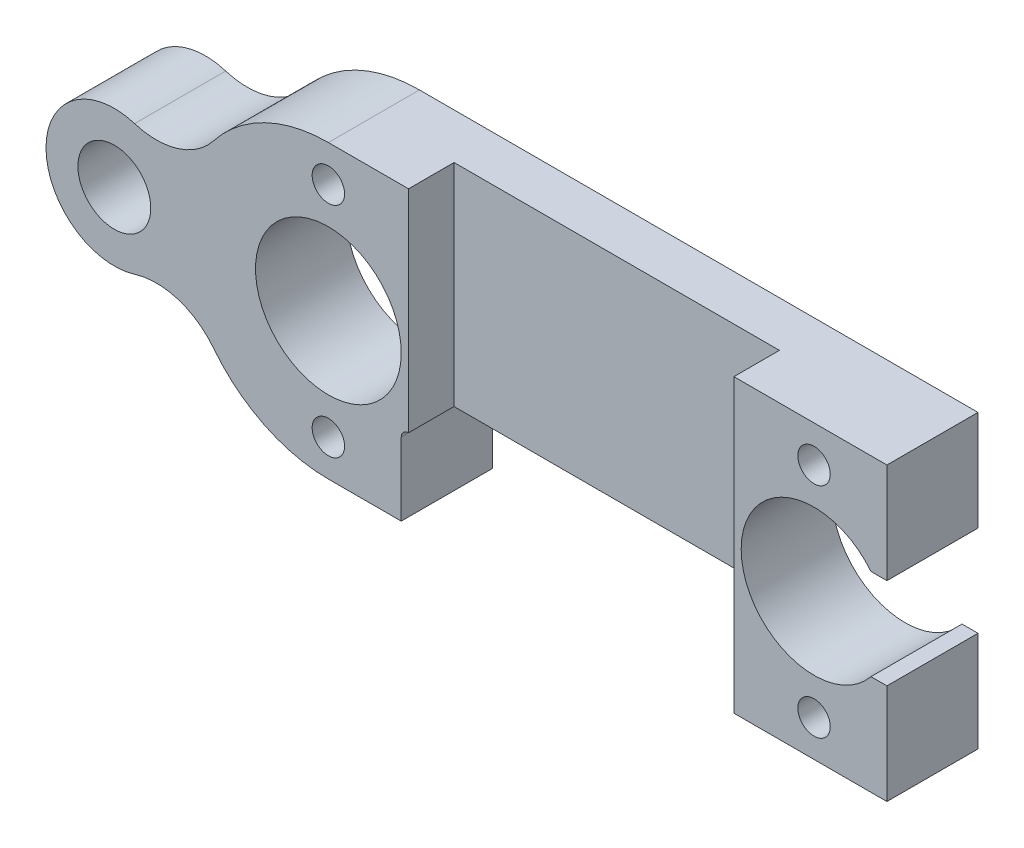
ISO-10303-21;
HEADER;
FILE_DESCRIPTION(('STEP AP214'),'2;1');
FILE_NAME('part.step','',(''),(''),'','','');
FILE_SCHEMA(('AUTOMOTIVE_DESIGN { 1 0 10303 214 1 1 1 1 }'));
ENDSEC;
DATA;
#1=APPLICATION_CONTEXT('core data for automotive mechanical design processes');
#2=APPLICATION_PROTOCOL_DEFINITION('international standard','automotive_design',2000,#1);
#3=PRODUCT_CONTEXT('',#1,'mechanical');
#4=PRODUCT('Part','Part','',(#3));
#5=PRODUCT_RELATED_PRODUCT_CATEGORY('part','',(#4));
#6=PRODUCT_DEFINITION_FORMATION('','',#4);
#7=PRODUCT_DEFINITION_CONTEXT('part definition',#1,'design');
#8=PRODUCT_DEFINITION('design','',#6,#7);
#9=PRODUCT_DEFINITION_SHAPE('','',#8);
#10=(LENGTH_UNIT() NAMED_UNIT(*) SI_UNIT(.MILLI.,.METRE.));
#11=(NAMED_UNIT(*) PLANE_ANGLE_UNIT() SI_UNIT($,.RADIAN.));
#12=(NAMED_UNIT(*) SI_UNIT($,.STERADIAN.) SOLID_ANGLE_UNIT());
#13=UNCERTAINTY_MEASURE_WITH_UNIT(LENGTH_MEASURE(1.E-05),#10,'distance_accuracy_value','');
#14=(GEOMETRIC_REPRESENTATION_CONTEXT(3) GLOBAL_UNCERTAINTY_ASSIGNED_CONTEXT((#13)) GLOBAL_UNIT_ASSIGNED_CONTEXT((#10,
#11,#12)) REPRESENTATION_CONTEXT('',''));
#15=CARTESIAN_POINT('',(0.,0.,0.));
#16=DIRECTION('',(0.,0.,1.));
#17=DIRECTION('',(1.,0.,0.));
#18=AXIS2_PLACEMENT_3D('',#15,#16,#17);
#19=CARTESIAN_POINT('',(-14.6052067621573,5.3846618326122,6.35));
#20=DIRECTION('',(0.,0.,1.));
#21=DIRECTION('',(1.,0.,0.));
#22=AXIS2_PLACEMENT_3D('',#19,#20,#21);
#23=PLANE('',#22);
#24=DIRECTION('',(-1.,0.,0.));
#25=VECTOR('',#24,1.);
#26=CARTESIAN_POINT('',(24.3329932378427,15.5446618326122,6.35));
#27=LINE('',#26,#25);
#28=CARTESIAN_POINT('',(24.3329932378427,15.5446618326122,6.35));
#29=VERTEX_POINT('',#28);
#30=CARTESIAN_POINT('',(13.6649932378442,15.5446618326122,6.35));
#31=VERTEX_POINT('',#30);
#32=EDGE_CURVE('E241',#29,#31,#27,.T.);
#33=ORIENTED_EDGE('',*,*,#32,.T.);
#34=DIRECTION('',(0.,-1.,0.));
#35=VECTOR('',#34,1.);
#36=CARTESIAN_POINT('',(13.6649932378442,-4.77533816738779,6.35));
#37=LINE('',#36,#35);
#38=CARTESIAN_POINT('',(13.6649932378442,-4.77533816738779,6.35));
#39=VERTEX_POINT('',#38);
#40=EDGE_CURVE('E185',#31,#39,#37,.T.);
#41=ORIENTED_EDGE('',*,*,#40,.T.);
#42=DIRECTION('',(1.,0.,0.));
#43=VECTOR('',#42,1.);
#44=CARTESIAN_POINT('',(13.6649932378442,-4.77533816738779,6.35));
#45=LINE('',#44,#43);
#46=CARTESIAN_POINT('',(24.3329932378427,-4.77533816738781,6.35));
#47=VERTEX_POINT('',#46);
#48=EDGE_CURVE('E259',#39,#47,#45,.T.);
#49=ORIENTED_EDGE('',*,*,#48,.T.);
#50=DIRECTION('',(0.,1.,0.));
#51=VECTOR('',#50,1.);
#52=CARTESIAN_POINT('',(24.3329932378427,-4.77533816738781,6.35));
#53=LINE('',#52,#51);
#54=CARTESIAN_POINT('',(24.3329932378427,2.2096618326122,6.35));
#55=VERTEX_POINT('',#54);
#56=EDGE_CURVE('E261',#47,#55,#53,.T.);
#57=ORIENTED_EDGE('',*,*,#56,.T.);
#58=DIRECTION('',(-1.,0.,0.));
#59=VECTOR('',#58,1.);
#60=CARTESIAN_POINT('',(23.2185669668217,2.2096618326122,6.35));
#61=LINE('',#60,#59);
#62=CARTESIAN_POINT('',(23.2185669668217,2.2096618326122,6.35));
#63=VERTEX_POINT('',#62);
#64=EDGE_CURVE('E263',#55,#63,#61,.T.);
#65=ORIENTED_EDGE('',*,*,#64,.T.);
#66=CARTESIAN_POINT('',(19.2529932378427,5.38466183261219,6.35));
#67=DIRECTION('',(0.,0.,-1.));
#68=DIRECTION('',(1.,0.,0.));
#69=AXIS2_PLACEMENT_3D('',#66,#67,#68);
#70=CIRCLE('',#69,5.07999999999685);
#71=CARTESIAN_POINT('',(23.2185669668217,8.55966183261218,6.35));
#72=VERTEX_POINT('',#71);
#73=EDGE_CURVE('E265',#63,#72,#70,.T.);
#74=ORIENTED_EDGE('',*,*,#73,.T.);
#75=DIRECTION('',(1.,0.,0.));
#76=VECTOR('',#75,1.);
#77=CARTESIAN_POINT('',(24.3329932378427,8.55966183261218,6.35));
#78=LINE('',#77,#76);
#79=CARTESIAN_POINT('',(24.3329932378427,8.55966183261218,6.35));
#80=VERTEX_POINT('',#79);
#81=EDGE_CURVE('E267',#72,#80,#78,.T.);
#82=ORIENTED_EDGE('',*,*,#81,.T.);
#83=DIRECTION('',(0.,1.,0.));
#84=VECTOR('',#83,1.);
#85=CARTESIAN_POINT('',(24.3329932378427,8.55966183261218,6.35));
#86=LINE('',#85,#84);
#87=EDGE_CURVE('E236',#80,#29,#86,.T.);
#88=ORIENTED_EDGE('',*,*,#87,.T.);
#89=EDGE_LOOP('',(#33,#41,#49,#57,#65,#74,#82,#88));
#90=FACE_BOUND('',#89,.T.);
#91=CARTESIAN_POINT('',(19.2529932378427,13.0046618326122,6.35));
#92=DIRECTION('',(0.,0.,1.));
#93=DIRECTION('',(1.,0.,0.));
#94=AXIS2_PLACEMENT_3D('',#91,#92,#93);
#95=CIRCLE('',#94,1.13029999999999);
#96=CARTESIAN_POINT('',(20.3832932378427,13.0046618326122,6.35));
#97=VERTEX_POINT('',#96);
#98=EDGE_CURVE('E205',#97,#97,#95,.T.);
#99=ORIENTED_EDGE('',*,*,#98,.F.);
#100=EDGE_LOOP('',(#99));
#101=FACE_BOUND('',#100,.T.);
#102=CARTESIAN_POINT('',(19.2529932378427,-2.23533816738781,6.35));
#103=DIRECTION('',(0.,0.,1.));
#104=DIRECTION('',(1.,0.,0.));
#105=AXIS2_PLACEMENT_3D('',#102,#103,#104);
#106=CIRCLE('',#105,1.13029999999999);
#107=CARTESIAN_POINT('',(20.3832932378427,-2.23533816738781,6.35));
#108=VERTEX_POINT('',#107);
#109=EDGE_CURVE('E199',#108,#108,#106,.T.);
#110=ORIENTED_EDGE('',*,*,#109,.F.);
#111=EDGE_LOOP('',(#110));
#112=FACE_BOUND('',#111,.T.);
#113=ADVANCED_FACE('F33',(#90,#101,#112),#23,.T.);
#114=CARTESIAN_POINT('',(13.6649932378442,0.812661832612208,6.35));
#115=DIRECTION('',(0.,1.,0.));
#116=DIRECTION('',(-1.,0.,0.));
#117=AXIS2_PLACEMENT_3D('',#114,#115,#116);
#118=PLANE('',#117);
#119=DIRECTION('',(1.,0.,0.));
#120=VECTOR('',#119,1.);
#121=CARTESIAN_POINT('',(13.6649932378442,0.812661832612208,3.175));
#122=LINE('',#121,#120);
#123=CARTESIAN_POINT('',(-9.01720676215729,0.812661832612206,3.175));
#124=VERTEX_POINT('',#123);
#125=CARTESIAN_POINT('',(13.1569932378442,0.812661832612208,3.175));
#126=VERTEX_POINT('',#125);
#127=EDGE_CURVE('E47',#124,#126,#122,.T.);
#128=ORIENTED_EDGE('',*,*,#127,.F.);
#129=DIRECTION('',(0.,0.,-1.));
#130=VECTOR('',#129,1.);
#131=CARTESIAN_POINT('',(-9.01720676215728,0.812661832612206,0.));
#132=LINE('',#131,#130);
#133=CARTESIAN_POINT('',(-9.01720676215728,0.812661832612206,0.));
#134=VERTEX_POINT('',#133);
#135=EDGE_CURVE('E346',#124,#134,#132,.T.);
#136=ORIENTED_EDGE('',*,*,#135,.T.);
#137=DIRECTION('',(1.,0.,0.));
#138=VECTOR('',#137,1.);
#139=CARTESIAN_POINT('',(13.6649932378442,0.812661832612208,0.));
#140=LINE('',#139,#138);
#141=CARTESIAN_POINT('',(13.1569932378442,0.812661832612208,0.));
#142=VERTEX_POINT('',#141);
#143=EDGE_CURVE('E289',#134,#142,#140,.T.);
#144=ORIENTED_EDGE('',*,*,#143,.T.);
#145=DIRECTION('',(0.,0.,-1.));
#146=VECTOR('',#145,1.);
#147=CARTESIAN_POINT('',(13.1569932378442,0.812661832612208,6.35));
#148=LINE('',#147,#146);
#149=EDGE_CURVE('E343',#142,#126,#148,.F.);
#150=ORIENTED_EDGE('',*,*,#149,.T.);
#151=EDGE_LOOP('',(#128,#136,#144,#150));
#152=FACE_BOUND('',#151,.T.);
#153=ADVANCED_FACE('F366',(#152),#118,.F.);
#154=CARTESIAN_POINT('',(13.1569932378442,0.304661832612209,6.35));
#155=DIRECTION('',(0.,0.,1.));
#156=DIRECTION('',(1.,0.,0.));
#157=AXIS2_PLACEMENT_3D('',#154,#155,#156);
#158=CYLINDRICAL_SURFACE('',#157,0.508);
#159=CARTESIAN_POINT('',(13.1569932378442,0.304661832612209,3.175));
#160=DIRECTION('',(0.,0.,1.));
#161=DIRECTION('',(1.,0.,0.));
#162=AXIS2_PLACEMENT_3D('',#159,#160,#161);
#163=CIRCLE('',#162,0.508);
#164=CARTESIAN_POINT('',(13.6649932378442,0.304661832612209,3.175));
#165=VERTEX_POINT('',#164);
#166=EDGE_CURVE('E11',#126,#165,#163,.F.);
#167=ORIENTED_EDGE('',*,*,#166,.F.);
#168=ORIENTED_EDGE('',*,*,#149,.F.);
#169=CARTESIAN_POINT('',(13.1569932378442,0.304661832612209,0.));
#170=DIRECTION('',(0.,0.,1.));
#171=DIRECTION('',(1.,0.,0.));
#172=AXIS2_PLACEMENT_3D('',#169,#170,#171);
#173=CIRCLE('',#172,0.508);
#174=CARTESIAN_POINT('',(13.6649932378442,0.304661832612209,0.));
#175=VERTEX_POINT('',#174);
#176=EDGE_CURVE('E41',#175,#142,#173,.T.);
#177=ORIENTED_EDGE('',*,*,#176,.F.);
#178=DIRECTION('',(0.,0.,-1.));
#179=VECTOR('',#178,1.);
#180=CARTESIAN_POINT('',(13.6649932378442,0.304661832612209,0.));
#181=LINE('',#180,#179);
#182=EDGE_CURVE('E55',#165,#175,#181,.T.);
#183=ORIENTED_EDGE('',*,*,#182,.F.);
#184=EDGE_LOOP('',(#167,#168,#177,#183));
#185=FACE_BOUND('',#184,.T.);
#186=ADVANCED_FACE('F35',(#185),#158,.F.);
#187=DIRECTION('',(0.,-1.,0.));
#188=VECTOR('',#187,1.);
#189=CARTESIAN_POINT('',(-9.01720676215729,-4.77533816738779,6.35));
#190=LINE('',#189,#188);
#191=CARTESIAN_POINT('',(-9.0172067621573,15.5446618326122,6.35));
#192=VERTEX_POINT('',#191);
#193=CARTESIAN_POINT('',(-9.01720676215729,0.812661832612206,6.35));
#194=VERTEX_POINT('',#193);
#195=EDGE_CURVE('E179',#192,#194,#190,.T.);
#196=ORIENTED_EDGE('',*,*,#195,.F.);
#197=CARTESIAN_POINT('',(-14.6052067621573,15.5446618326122,6.35));
#198=VERTEX_POINT('',#197);
#199=EDGE_CURVE('E239',#192,#198,#27,.T.);
#200=ORIENTED_EDGE('',*,*,#199,.T.);
#201=CARTESIAN_POINT('',(-14.6052067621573,5.3846618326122,6.35));
#202=DIRECTION('',(0.,0.,1.));
#203=DIRECTION('',(1.,0.,0.));
#204=AXIS2_PLACEMENT_3D('',#201,#202,#203);
#205=CIRCLE('',#204,10.16);
#206=CARTESIAN_POINT('',(-22.603504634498,11.6498698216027,6.35));
#207=VERTEX_POINT('',#206);
#208=EDGE_CURVE('E243',#198,#207,#205,.T.);
#209=ORIENTED_EDGE('',*,*,#208,.T.);
#210=CARTESIAN_POINT('',(-26.6026535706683,14.7824738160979,6.35));
#211=DIRECTION('',(0.,0.,-1.));
#212=DIRECTION('',(1.,0.,0.));
#213=AXIS2_PLACEMENT_3D('',#210,#211,#212);
#214=CIRCLE('',#213,5.08);
#215=CARTESIAN_POINT('',(-28.112358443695,9.93199021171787,6.35));
#216=VERTEX_POINT('',#215);
#217=EDGE_CURVE('E245',#207,#216,#214,.T.);
#218=ORIENTED_EDGE('',*,*,#217,.T.);
#219=CARTESIAN_POINT('',(-29.5277067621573,5.38466183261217,6.35));
#220=DIRECTION('',(0.,0.,1.));
#221=DIRECTION('',(1.,0.,0.));
#222=AXIS2_PLACEMENT_3D('',#219,#220,#221);
#223=CIRCLE('',#222,4.76249999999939);
#224=CARTESIAN_POINT('',(-28.112358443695,0.837333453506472,6.35));
#225=VERTEX_POINT('',#224);
#226=EDGE_CURVE('E247',#216,#225,#223,.T.);
#227=ORIENTED_EDGE('',*,*,#226,.T.);
#228=CARTESIAN_POINT('',(-26.6026535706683,-4.01315015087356,6.35));
#229=DIRECTION('',(0.,0.,-1.));
#230=DIRECTION('',(-1.,0.,0.));
#231=AXIS2_PLACEMENT_3D('',#228,#229,#230);
#232=CIRCLE('',#231,5.08);
#233=CARTESIAN_POINT('',(-22.603504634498,-0.880546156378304,6.35));
#234=VERTEX_POINT('',#233);
#235=EDGE_CURVE('E249',#225,#234,#232,.T.);
#236=ORIENTED_EDGE('',*,*,#235,.T.);
#237=CARTESIAN_POINT('',(-14.6052067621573,5.3846618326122,6.35));
#238=DIRECTION('',(0.,0.,1.));
#239=DIRECTION('',(1.,0.,0.));
#240=AXIS2_PLACEMENT_3D('',#237,#238,#239);
#241=CIRCLE('',#240,10.16);
#242=CARTESIAN_POINT('',(-14.6052067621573,-4.77533816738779,6.35));
#243=VERTEX_POINT('',#242);
#244=EDGE_CURVE('E251',#234,#243,#241,.T.);
#245=ORIENTED_EDGE('',*,*,#244,.T.);
#246=DIRECTION('',(1.,0.,0.));
#247=VECTOR('',#246,1.);
#248=CARTESIAN_POINT('',(-14.6052067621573,-4.77533816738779,6.35));
#249=LINE('',#248,#247);
#250=CARTESIAN_POINT('',(-9.52520676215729,-4.77533816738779,6.35));
#251=VERTEX_POINT('',#250);
#252=EDGE_CURVE('E253',#243,#251,#249,.T.);
#253=ORIENTED_EDGE('',*,*,#252,.T.);
#254=DIRECTION('',(0.,1.,0.));
#255=VECTOR('',#254,1.);
#256=CARTESIAN_POINT('',(-9.52520676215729,0.812661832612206,6.35));
#257=LINE('',#256,#255);
#258=CARTESIAN_POINT('',(-9.52520676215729,0.304661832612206,6.35));
#259=VERTEX_POINT('',#258);
#260=EDGE_CURVE('E255',#251,#259,#257,.T.);
#261=ORIENTED_EDGE('',*,*,#260,.T.);
#262=CARTESIAN_POINT('',(-9.01720676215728,0.304661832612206,6.35));
#263=DIRECTION('',(0.,0.,1.));
#264=DIRECTION('',(1.,0.,0.));
#265=AXIS2_PLACEMENT_3D('',#262,#263,#264);
#266=CIRCLE('',#265,0.508);
#267=EDGE_CURVE('E354',#259,#194,#266,.F.);
#268=ORIENTED_EDGE('',*,*,#267,.T.);
#269=EDGE_LOOP('',(#196,#200,#209,#218,#227,#236,#245,#253,#261,#268));
#270=FACE_BOUND('',#269,.T.);
#271=CARTESIAN_POINT('',(-14.6052067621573,13.0046618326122,6.35));
#272=DIRECTION('',(0.,0.,1.));
#273=DIRECTION('',(1.,0.,0.));
#274=AXIS2_PLACEMENT_3D('',#271,#272,#273);
#275=CIRCLE('',#274,1.13029999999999);
#276=CARTESIAN_POINT('',(-13.4749067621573,13.0046618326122,6.35));
#277=VERTEX_POINT('',#276);
#278=EDGE_CURVE('E211',#277,#277,#275,.T.);
#279=ORIENTED_EDGE('',*,*,#278,.F.);
#280=EDGE_LOOP('',(#279));
#281=FACE_BOUND('',#280,.T.);
#282=CARTESIAN_POINT('',(-14.6052067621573,-2.23533816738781,6.35));
#283=DIRECTION('',(0.,0.,1.));
#284=DIRECTION('',(1.,0.,0.));
#285=AXIS2_PLACEMENT_3D('',#282,#283,#284);
#286=CIRCLE('',#285,1.13029999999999);
#287=CARTESIAN_POINT('',(-13.4749067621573,-2.23533816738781,6.35));
#288=VERTEX_POINT('',#287);
#289=EDGE_CURVE('E217',#288,#288,#286,.T.);
#290=ORIENTED_EDGE('',*,*,#289,.F.);
#291=EDGE_LOOP('',(#290));
#292=FACE_BOUND('',#291,.T.);
#293=CARTESIAN_POINT('',(-14.6052067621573,5.3846618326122,6.35));
#294=DIRECTION('',(0.,0.,1.));
#295=DIRECTION('',(1.,0.,0.));
#296=AXIS2_PLACEMENT_3D('',#293,#294,#295);
#297=CIRCLE('',#296,5.07999999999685);
#298=CARTESIAN_POINT('',(-9.52520676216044,5.3846618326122,6.35));
#299=VERTEX_POINT('',#298);
#300=EDGE_CURVE('E230',#299,#299,#297,.T.);
#301=ORIENTED_EDGE('',*,*,#300,.F.);
#302=EDGE_LOOP('',(#301));
#303=FACE_BOUND('',#302,.T.);
#304=CARTESIAN_POINT('',(-29.5277067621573,5.38466183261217,6.35));
#305=DIRECTION('',(0.,0.,1.));
#306=DIRECTION('',(1.,0.,0.));
#307=AXIS2_PLACEMENT_3D('',#304,#305,#306);
#308=CIRCLE('',#307,2.53999999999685);
#309=CARTESIAN_POINT('',(-26.9877067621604,5.38466183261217,6.35));
#310=VERTEX_POINT('',#309);
#311=EDGE_CURVE('E224',#310,#310,#308,.T.);
#312=ORIENTED_EDGE('',*,*,#311,.F.);
#313=EDGE_LOOP('',(#312));
#314=FACE_BOUND('',#313,.T.);
#315=ADVANCED_FACE('F370',(#270,#281,#292,#303,#314),#23,.T.);
#316=CARTESIAN_POINT('',(-14.6052067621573,5.3846618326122,0.));
#317=DIRECTION('',(0.,0.,1.));
#318=DIRECTION('',(1.,0.,0.));
#319=AXIS2_PLACEMENT_3D('',#316,#317,#318);
#320=PLANE('',#319);
#321=CARTESIAN_POINT('',(19.2529932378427,-2.23533816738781,0.));
#322=DIRECTION('',(0.,0.,1.));
#323=DIRECTION('',(1.,0.,0.));
#324=AXIS2_PLACEMENT_3D('',#321,#322,#323);
#325=CIRCLE('',#324,1.1303);
#326=CARTESIAN_POINT('',(20.3832932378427,-2.23533816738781,0.));
#327=VERTEX_POINT('',#326);
#328=EDGE_CURVE('E202',#327,#327,#325,.T.);
#329=ORIENTED_EDGE('',*,*,#328,.T.);
#330=EDGE_LOOP('',(#329));
#331=FACE_BOUND('',#330,.T.);
#332=CARTESIAN_POINT('',(19.2529932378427,13.0046618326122,0.));
#333=DIRECTION('',(0.,0.,1.));
#334=DIRECTION('',(1.,0.,0.));
#335=AXIS2_PLACEMENT_3D('',#332,#333,#334);
#336=CIRCLE('',#335,1.1303);
#337=CARTESIAN_POINT('',(20.3832932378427,13.0046618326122,0.));
#338=VERTEX_POINT('',#337);
#339=EDGE_CURVE('E208',#338,#338,#336,.T.);
#340=ORIENTED_EDGE('',*,*,#339,.T.);
#341=EDGE_LOOP('',(#340));
#342=FACE_BOUND('',#341,.T.);
#343=CARTESIAN_POINT('',(-14.6052067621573,13.0046618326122,0.));
#344=DIRECTION('',(0.,0.,1.));
#345=DIRECTION('',(1.,0.,0.));
#346=AXIS2_PLACEMENT_3D('',#343,#344,#345);
#347=CIRCLE('',#346,1.1303);
#348=CARTESIAN_POINT('',(-13.4749067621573,13.0046618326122,0.));
#349=VERTEX_POINT('',#348);
#350=EDGE_CURVE('E214',#349,#349,#347,.T.);
#351=ORIENTED_EDGE('',*,*,#350,.T.);
#352=EDGE_LOOP('',(#351));
#353=FACE_BOUND('',#352,.T.);
#354=CARTESIAN_POINT('',(-14.6052067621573,-2.23533816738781,0.));
#355=DIRECTION('',(0.,0.,1.));
#356=DIRECTION('',(1.,0.,0.));
#357=AXIS2_PLACEMENT_3D('',#354,#355,#356);
#358=CIRCLE('',#357,1.1303);
#359=CARTESIAN_POINT('',(-13.4749067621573,-2.23533816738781,0.));
#360=VERTEX_POINT('',#359);
#361=EDGE_CURVE('E220',#360,#360,#358,.T.);
#362=ORIENTED_EDGE('',*,*,#361,.T.);
#363=EDGE_LOOP('',(#362));
#364=FACE_BOUND('',#363,.T.);
#365=CARTESIAN_POINT('',(-14.6052067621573,5.3846618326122,0.));
#366=DIRECTION('',(0.,0.,1.));
#367=DIRECTION('',(1.,0.,0.));
#368=AXIS2_PLACEMENT_3D('',#365,#366,#367);
#369=CIRCLE('',#368,5.07999999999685);
#370=CARTESIAN_POINT('',(-9.52520676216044,5.3846618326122,0.));
#371=VERTEX_POINT('',#370);
#372=EDGE_CURVE('E227',#371,#371,#369,.T.);
#373=ORIENTED_EDGE('',*,*,#372,.T.);
#374=EDGE_LOOP('',(#373));
#375=FACE_BOUND('',#374,.T.);
#376=DIRECTION('',(0.,1.,0.));
#377=VECTOR('',#376,1.);
#378=CARTESIAN_POINT('',(24.3329932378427,8.55966183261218,0.));
#379=LINE('',#378,#377);
#380=CARTESIAN_POINT('',(24.3329932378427,8.55966183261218,0.));
#381=VERTEX_POINT('',#380);
#382=CARTESIAN_POINT('',(24.3329932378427,15.5446618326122,0.));
#383=VERTEX_POINT('',#382);
#384=EDGE_CURVE('E233',#381,#383,#379,.T.);
#385=ORIENTED_EDGE('',*,*,#384,.F.);
#386=DIRECTION('',(1.,0.,0.));
#387=VECTOR('',#386,1.);
#388=CARTESIAN_POINT('',(24.3329932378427,8.55966183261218,0.));
#389=LINE('',#388,#387);
#390=CARTESIAN_POINT('',(23.2185669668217,8.55966183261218,0.));
#391=VERTEX_POINT('',#390);
#392=EDGE_CURVE('E240',#391,#381,#389,.T.);
#393=ORIENTED_EDGE('',*,*,#392,.F.);
#394=CARTESIAN_POINT('',(19.2529932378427,5.38466183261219,0.));
#395=DIRECTION('',(0.,0.,-1.));
#396=DIRECTION('',(1.,0.,0.));
#397=AXIS2_PLACEMENT_3D('',#394,#395,#396);
#398=CIRCLE('',#397,5.07999999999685);
#399=CARTESIAN_POINT('',(23.2185669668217,2.2096618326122,0.));
#400=VERTEX_POINT('',#399);
#401=EDGE_CURVE('E300',#400,#391,#398,.T.);
#402=ORIENTED_EDGE('',*,*,#401,.F.);
#403=DIRECTION('',(-1.,0.,0.));
#404=VECTOR('',#403,1.);
#405=CARTESIAN_POINT('',(23.2185669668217,2.2096618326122,0.));
#406=LINE('',#405,#404);
#407=CARTESIAN_POINT('',(24.3329932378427,2.2096618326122,0.));
#408=VERTEX_POINT('',#407);
#409=EDGE_CURVE('E298',#408,#400,#406,.T.);
#410=ORIENTED_EDGE('',*,*,#409,.F.);
#411=DIRECTION('',(0.,1.,0.));
#412=VECTOR('',#411,1.);
#413=CARTESIAN_POINT('',(24.3329932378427,-4.77533816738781,0.));
#414=LINE('',#413,#412);
#415=CARTESIAN_POINT('',(24.3329932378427,-4.77533816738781,0.));
#416=VERTEX_POINT('',#415);
#417=EDGE_CURVE('E296',#416,#408,#414,.T.);
#418=ORIENTED_EDGE('',*,*,#417,.F.);
#419=DIRECTION('',(1.,0.,0.));
#420=VECTOR('',#419,1.);
#421=CARTESIAN_POINT('',(13.6649932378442,-4.77533816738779,0.));
#422=LINE('',#421,#420);
#423=CARTESIAN_POINT('',(13.6649932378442,-4.77533816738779,0.));
#424=VERTEX_POINT('',#423);
#425=EDGE_CURVE('E294',#424,#416,#422,.T.);
#426=ORIENTED_EDGE('',*,*,#425,.F.);
#427=DIRECTION('',(0.,-1.,0.));
#428=VECTOR('',#427,1.);
#429=CARTESIAN_POINT('',(13.6649932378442,-4.77533816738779,0.));
#430=LINE('',#429,#428);
#431=EDGE_CURVE('E292',#175,#424,#430,.T.);
#432=ORIENTED_EDGE('',*,*,#431,.F.);
#433=ORIENTED_EDGE('',*,*,#176,.T.);
#434=ORIENTED_EDGE('',*,*,#143,.F.);
#435=CARTESIAN_POINT('',(-9.01720676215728,0.304661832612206,0.));
#436=DIRECTION('',(0.,0.,1.));
#437=DIRECTION('',(1.,0.,0.));
#438=AXIS2_PLACEMENT_3D('',#435,#436,#437);
#439=CIRCLE('',#438,0.508);
#440=CARTESIAN_POINT('',(-9.52520676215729,0.304661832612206,0.));
#441=VERTEX_POINT('',#440);
#442=EDGE_CURVE('E352',#134,#441,#439,.T.);
#443=ORIENTED_EDGE('',*,*,#442,.T.);
#444=DIRECTION('',(0.,1.,0.));
#445=VECTOR('',#444,1.);
#446=CARTESIAN_POINT('',(-9.52520676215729,0.812661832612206,0.));
#447=LINE('',#446,#445);
#448=CARTESIAN_POINT('',(-9.52520676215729,-4.77533816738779,0.));
#449=VERTEX_POINT('',#448);
#450=EDGE_CURVE('E286',#449,#441,#447,.T.);
#451=ORIENTED_EDGE('',*,*,#450,.F.);
#452=DIRECTION('',(1.,0.,0.));
#453=VECTOR('',#452,1.);
#454=CARTESIAN_POINT('',(-14.6052067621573,-4.77533816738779,0.));
#455=LINE('',#454,#453);
#456=CARTESIAN_POINT('',(-14.6052067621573,-4.77533816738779,0.));
#457=VERTEX_POINT('',#456);
#458=EDGE_CURVE('E284',#457,#449,#455,.T.);
#459=ORIENTED_EDGE('',*,*,#458,.F.);
#460=CARTESIAN_POINT('',(-14.6052067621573,5.3846618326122,0.));
#461=DIRECTION('',(0.,0.,1.));
#462=DIRECTION('',(1.,0.,0.));
#463=AXIS2_PLACEMENT_3D('',#460,#461,#462);
#464=CIRCLE('',#463,10.16);
#465=CARTESIAN_POINT('',(-22.603504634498,-0.880546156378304,0.));
#466=VERTEX_POINT('',#465);
#467=EDGE_CURVE('E282',#466,#457,#464,.T.);
#468=ORIENTED_EDGE('',*,*,#467,.F.);
#469=CARTESIAN_POINT('',(-26.6026535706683,-4.01315015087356,0.));
#470=DIRECTION('',(0.,0.,-1.));
#471=DIRECTION('',(-1.,0.,0.));
#472=AXIS2_PLACEMENT_3D('',#469,#470,#471);
#473=CIRCLE('',#472,5.08);
#474=CARTESIAN_POINT('',(-28.112358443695,0.837333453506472,0.));
#475=VERTEX_POINT('',#474);
#476=EDGE_CURVE('E280',#475,#466,#473,.T.);
#477=ORIENTED_EDGE('',*,*,#476,.F.);
#478=CARTESIAN_POINT('',(-29.5277067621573,5.38466183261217,0.));
#479=DIRECTION('',(0.,0.,1.));
#480=DIRECTION('',(1.,0.,0.));
#481=AXIS2_PLACEMENT_3D('',#478,#479,#480);
#482=CIRCLE('',#481,4.76249999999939);
#483=CARTESIAN_POINT('',(-28.112358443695,9.93199021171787,0.));
#484=VERTEX_POINT('',#483);
#485=EDGE_CURVE('E278',#484,#475,#482,.T.);
#486=ORIENTED_EDGE('',*,*,#485,.F.);
#487=CARTESIAN_POINT('',(-26.6026535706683,14.7824738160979,0.));
#488=DIRECTION('',(0.,0.,-1.));
#489=DIRECTION('',(1.,0.,0.));
#490=AXIS2_PLACEMENT_3D('',#487,#488,#489);
#491=CIRCLE('',#490,5.08);
#492=CARTESIAN_POINT('',(-22.603504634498,11.6498698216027,0.));
#493=VERTEX_POINT('',#492);
#494=EDGE_CURVE('E276',#493,#484,#491,.T.);
#495=ORIENTED_EDGE('',*,*,#494,.F.);
#496=CARTESIAN_POINT('',(-14.6052067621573,5.3846618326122,0.));
#497=DIRECTION('',(0.,0.,1.));
#498=DIRECTION('',(1.,0.,0.));
#499=AXIS2_PLACEMENT_3D('',#496,#497,#498);
#500=CIRCLE('',#499,10.16);
#501=CARTESIAN_POINT('',(-14.6052067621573,15.5446618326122,0.));
#502=VERTEX_POINT('',#501);
#503=EDGE_CURVE('E274',#502,#493,#500,.T.);
#504=ORIENTED_EDGE('',*,*,#503,.F.);
#505=DIRECTION('',(-1.,0.,0.));
#506=VECTOR('',#505,1.);
#507=CARTESIAN_POINT('',(24.3329932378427,15.5446618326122,0.));
#508=LINE('',#507,#506);
#509=EDGE_CURVE('E272',#383,#502,#508,.T.);
#510=ORIENTED_EDGE('',*,*,#509,.F.);
#511=EDGE_LOOP('',(#385,#393,#402,#410,#418,#426,#432,#433,#434,#443,#451,#459,#468,#477,#486,
#495,#504,#510));
#512=FACE_BOUND('',#511,.T.);
#513=CARTESIAN_POINT('',(-29.5277067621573,5.38466183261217,0.));
#514=DIRECTION('',(0.,0.,1.));
#515=DIRECTION('',(1.,0.,0.));
#516=AXIS2_PLACEMENT_3D('',#513,#514,#515);
#517=CIRCLE('',#516,2.53999999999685);
#518=CARTESIAN_POINT('',(-26.9877067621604,5.38466183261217,0.));
#519=VERTEX_POINT('',#518);
#520=EDGE_CURVE('E223',#519,#519,#517,.T.);
#521=ORIENTED_EDGE('',*,*,#520,.T.);
#522=EDGE_LOOP('',(#521));
#523=FACE_BOUND('',#522,.T.);
#524=ADVANCED_FACE('F360',(#331,#342,#353,#364,#375,#512,#523),#320,.F.);
#525=CARTESIAN_POINT('',(24.3329932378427,8.55966183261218,6.35));
#526=DIRECTION('',(-1.,0.,0.));
#527=DIRECTION('',(0.,0.,1.));
#528=AXIS2_PLACEMENT_3D('',#525,#526,#527);
#529=PLANE('',#528);
#530=ORIENTED_EDGE('',*,*,#384,.T.);
#531=DIRECTION('',(0.,0.,-1.));
#532=VECTOR('',#531,1.);
#533=CARTESIAN_POINT('',(24.3329932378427,15.5446618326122,6.35));
#534=LINE('',#533,#532);
#535=EDGE_CURVE('E340',#29,#383,#534,.T.);
#536=ORIENTED_EDGE('',*,*,#535,.F.);
#537=ORIENTED_EDGE('',*,*,#87,.F.);
#538=DIRECTION('',(0.,0.,-1.));
#539=VECTOR('',#538,1.);
#540=CARTESIAN_POINT('',(24.3329932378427,8.55966183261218,6.35));
#541=LINE('',#540,#539);
#542=EDGE_CURVE('E269',#80,#381,#541,.T.);
#543=ORIENTED_EDGE('',*,*,#542,.T.);
#544=EDGE_LOOP('',(#530,#536,#537,#543));
#545=FACE_BOUND('',#544,.T.);
#546=ADVANCED_FACE('F389',(#545),#529,.F.);
#547=CARTESIAN_POINT('',(24.3329932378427,15.5446618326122,6.35));
#548=DIRECTION('',(0.,-1.,0.));
#549=DIRECTION('',(1.,0.,0.));
#550=AXIS2_PLACEMENT_3D('',#547,#548,#549);
#551=PLANE('',#550);
#552=DIRECTION('',(-1.,0.,0.));
#553=VECTOR('',#552,1.);
#554=CARTESIAN_POINT('',(13.6649932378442,15.5446618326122,3.175));
#555=LINE('',#554,#553);
#556=CARTESIAN_POINT('',(13.6649932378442,15.5446618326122,3.175));
#557=VERTEX_POINT('',#556);
#558=CARTESIAN_POINT('',(-9.0172067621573,15.5446618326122,3.175));
#559=VERTEX_POINT('',#558);
#560=EDGE_CURVE('E177',#557,#559,#555,.T.);
#561=ORIENTED_EDGE('',*,*,#560,.F.);
#562=DIRECTION('',(0.,0.,1.));
#563=VECTOR('',#562,1.);
#564=CARTESIAN_POINT('',(13.6649932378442,15.5446618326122,3.175));
#565=LINE('',#564,#563);
#566=EDGE_CURVE('E182',#557,#31,#565,.T.);
#567=ORIENTED_EDGE('',*,*,#566,.T.);
#568=ORIENTED_EDGE('',*,*,#32,.F.);
#569=ORIENTED_EDGE('',*,*,#535,.T.);
#570=ORIENTED_EDGE('',*,*,#509,.T.);
#571=DIRECTION('',(0.,0.,-1.));
#572=VECTOR('',#571,1.);
#573=CARTESIAN_POINT('',(-14.6052067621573,15.5446618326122,6.35));
#574=LINE('',#573,#572);
#575=EDGE_CURVE('E337',#198,#502,#574,.T.);
#576=ORIENTED_EDGE('',*,*,#575,.F.);
#577=ORIENTED_EDGE('',*,*,#199,.F.);
#578=DIRECTION('',(0.,0.,1.));
#579=VECTOR('',#578,1.);
#580=CARTESIAN_POINT('',(-9.0172067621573,15.5446618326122,3.175));
#581=LINE('',#580,#579);
#582=EDGE_CURVE('E188',#559,#192,#581,.T.);
#583=ORIENTED_EDGE('',*,*,#582,.F.);
#584=EDGE_LOOP('',(#561,#567,#568,#569,#570,#576,#577,#583));
#585=FACE_BOUND('',#584,.T.);
#586=ADVANCED_FACE('F191',(#585),#551,.F.);
#587=CARTESIAN_POINT('',(-14.6052067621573,5.3846618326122,6.35));
#588=DIRECTION('',(0.,0.,-1.));
#589=DIRECTION('',(-1.,0.,0.));
#590=AXIS2_PLACEMENT_3D('',#587,#588,#589);
#591=CYLINDRICAL_SURFACE('',#590,10.16);
#592=ORIENTED_EDGE('',*,*,#503,.T.);
#593=DIRECTION('',(0.,0.,-1.));
#594=VECTOR('',#593,1.);
#595=CARTESIAN_POINT('',(-22.603504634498,11.6498698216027,6.35));
#596=LINE('',#595,#594);
#597=EDGE_CURVE('E334',#207,#493,#596,.T.);
#598=ORIENTED_EDGE('',*,*,#597,.F.);
#599=ORIENTED_EDGE('',*,*,#208,.F.);
#600=ORIENTED_EDGE('',*,*,#575,.T.);
#601=EDGE_LOOP('',(#592,#598,#599,#600));
#602=FACE_BOUND('',#601,.T.);
#603=ADVANCED_FACE('F436',(#602),#591,.T.);
#604=CARTESIAN_POINT('',(-26.6026535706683,14.7824738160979,6.35));
#605=DIRECTION('',(0.,0.,-1.));
#606=DIRECTION('',(-1.,0.,0.));
#607=AXIS2_PLACEMENT_3D('',#604,#605,#606);
#608=CYLINDRICAL_SURFACE('',#607,5.08);
#609=ORIENTED_EDGE('',*,*,#494,.T.);
#610=DIRECTION('',(0.,0.,-1.));
#611=VECTOR('',#610,1.);
#612=CARTESIAN_POINT('',(-28.112358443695,9.93199021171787,6.35));
#613=LINE('',#612,#611);
#614=EDGE_CURVE('E331',#216,#484,#613,.T.);
#615=ORIENTED_EDGE('',*,*,#614,.F.);
#616=ORIENTED_EDGE('',*,*,#217,.F.);
#617=ORIENTED_EDGE('',*,*,#597,.T.);
#618=EDGE_LOOP('',(#609,#615,#616,#617));
#619=FACE_BOUND('',#618,.T.);
#620=ADVANCED_FACE('F432',(#619),#608,.F.);
#621=CARTESIAN_POINT('',(-29.5277067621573,5.38466183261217,6.35));
#622=DIRECTION('',(0.,0.,-1.));
#623=DIRECTION('',(-1.,0.,0.));
#624=AXIS2_PLACEMENT_3D('',#621,#622,#623);
#625=CYLINDRICAL_SURFACE('',#624,4.76249999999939);
#626=ORIENTED_EDGE('',*,*,#485,.T.);
#627=DIRECTION('',(0.,0.,-1.));
#628=VECTOR('',#627,1.);
#629=CARTESIAN_POINT('',(-28.112358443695,0.837333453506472,6.35));
#630=LINE('',#629,#628);
#631=EDGE_CURVE('E328',#225,#475,#630,.T.);
#632=ORIENTED_EDGE('',*,*,#631,.F.);
#633=ORIENTED_EDGE('',*,*,#226,.F.);
#634=ORIENTED_EDGE('',*,*,#614,.T.);
#635=EDGE_LOOP('',(#626,#632,#633,#634));
#636=FACE_BOUND('',#635,.T.);
#637=ADVANCED_FACE('F428',(#636),#625,.T.);
#638=CARTESIAN_POINT('',(-26.6026535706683,-4.01315015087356,6.35));
#639=DIRECTION('',(0.,0.,-1.));
#640=DIRECTION('',(-1.,0.,0.));
#641=AXIS2_PLACEMENT_3D('',#638,#639,#640);
#642=CYLINDRICAL_SURFACE('',#641,5.08);
#643=ORIENTED_EDGE('',*,*,#476,.T.);
#644=DIRECTION('',(0.,0.,-1.));
#645=VECTOR('',#644,1.);
#646=CARTESIAN_POINT('',(-22.603504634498,-0.880546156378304,6.35));
#647=LINE('',#646,#645);
#648=EDGE_CURVE('E325',#234,#466,#647,.T.);
#649=ORIENTED_EDGE('',*,*,#648,.F.);
#650=ORIENTED_EDGE('',*,*,#235,.F.);
#651=ORIENTED_EDGE('',*,*,#631,.T.);
#652=EDGE_LOOP('',(#643,#649,#650,#651));
#653=FACE_BOUND('',#652,.T.);
#654=ADVANCED_FACE('F424',(#653),#642,.F.);
#655=CARTESIAN_POINT('',(-14.6052067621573,5.3846618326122,6.35));
#656=DIRECTION('',(0.,0.,-1.));
#657=DIRECTION('',(-1.,0.,0.));
#658=AXIS2_PLACEMENT_3D('',#655,#656,#657);
#659=CYLINDRICAL_SURFACE('',#658,10.16);
#660=ORIENTED_EDGE('',*,*,#467,.T.);
#661=DIRECTION('',(0.,0.,-1.));
#662=VECTOR('',#661,1.);
#663=CARTESIAN_POINT('',(-14.6052067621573,-4.77533816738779,6.35));
#664=LINE('',#663,#662);
#665=EDGE_CURVE('E322',#243,#457,#664,.T.);
#666=ORIENTED_EDGE('',*,*,#665,.F.);
#667=ORIENTED_EDGE('',*,*,#244,.F.);
#668=ORIENTED_EDGE('',*,*,#648,.T.);
#669=EDGE_LOOP('',(#660,#666,#667,#668));
#670=FACE_BOUND('',#669,.T.);
#671=ADVANCED_FACE('F420',(#670),#659,.T.);
#672=CARTESIAN_POINT('',(-14.6052067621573,-4.77533816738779,6.35));
#673=DIRECTION('',(0.,1.,0.));
#674=DIRECTION('',(-1.,0.,0.));
#675=AXIS2_PLACEMENT_3D('',#672,#673,#674);
#676=PLANE('',#675);
#677=ORIENTED_EDGE('',*,*,#458,.T.);
#678=DIRECTION('',(0.,0.,-1.));
#679=VECTOR('',#678,1.);
#680=CARTESIAN_POINT('',(-9.52520676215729,-4.77533816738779,6.35));
#681=LINE('',#680,#679);
#682=EDGE_CURVE('E319',#251,#449,#681,.T.);
#683=ORIENTED_EDGE('',*,*,#682,.F.);
#684=ORIENTED_EDGE('',*,*,#252,.F.);
#685=ORIENTED_EDGE('',*,*,#665,.T.);
#686=EDGE_LOOP('',(#677,#683,#684,#685));
#687=FACE_BOUND('',#686,.T.);
#688=ADVANCED_FACE('F416',(#687),#676,.F.);
#689=CARTESIAN_POINT('',(-9.52520676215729,0.812661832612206,6.35));
#690=DIRECTION('',(-1.,0.,0.));
#691=DIRECTION('',(0.,0.,1.));
#692=AXIS2_PLACEMENT_3D('',#689,#690,#691);
#693=PLANE('',#692);
#694=ORIENTED_EDGE('',*,*,#450,.T.);
#695=DIRECTION('',(0.,0.,-1.));
#696=VECTOR('',#695,1.);
#697=CARTESIAN_POINT('',(-9.52520676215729,0.304661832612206,6.35));
#698=LINE('',#697,#696);
#699=EDGE_CURVE('E349',#441,#259,#698,.F.);
#700=ORIENTED_EDGE('',*,*,#699,.T.);
#701=ORIENTED_EDGE('',*,*,#260,.F.);
#702=ORIENTED_EDGE('',*,*,#682,.T.);
#703=EDGE_LOOP('',(#694,#700,#701,#702));
#704=FACE_BOUND('',#703,.T.);
#705=ADVANCED_FACE('F412',(#704),#693,.F.);
#706=CARTESIAN_POINT('',(13.6649932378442,-4.77533816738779,6.35));
#707=DIRECTION('',(1.,0.,0.));
#708=DIRECTION('',(0.,1.,0.));
#709=AXIS2_PLACEMENT_3D('',#706,#707,#708);
#710=PLANE('',#709);
#711=ORIENTED_EDGE('',*,*,#40,.F.);
#712=ORIENTED_EDGE('',*,*,#566,.F.);
#713=DIRECTION('',(0.,1.,0.));
#714=VECTOR('',#713,1.);
#715=CARTESIAN_POINT('',(13.6649932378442,-4.77533816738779,3.175));
#716=LINE('',#715,#714);
#717=EDGE_CURVE('E173',#165,#557,#716,.T.);
#718=ORIENTED_EDGE('',*,*,#717,.F.);
#719=ORIENTED_EDGE('',*,*,#182,.T.);
#720=ORIENTED_EDGE('',*,*,#431,.T.);
#721=DIRECTION('',(0.,0.,-1.));
#722=VECTOR('',#721,1.);
#723=CARTESIAN_POINT('',(13.6649932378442,-4.77533816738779,6.35));
#724=LINE('',#723,#722);
#725=EDGE_CURVE('E317',#39,#424,#724,.T.);
#726=ORIENTED_EDGE('',*,*,#725,.F.);
#727=EDGE_LOOP('',(#711,#712,#718,#719,#720,#726));
#728=FACE_BOUND('',#727,.T.);
#729=ADVANCED_FACE('F183',(#728),#710,.F.);
#730=CARTESIAN_POINT('',(13.6649932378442,-4.77533816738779,6.35));
#731=DIRECTION('',(0.,1.,0.));
#732=DIRECTION('',(-1.,0.,0.));
#733=AXIS2_PLACEMENT_3D('',#730,#731,#732);
#734=PLANE('',#733);
#735=ORIENTED_EDGE('',*,*,#425,.T.);
#736=DIRECTION('',(0.,0.,-1.));
#737=VECTOR('',#736,1.);
#738=CARTESIAN_POINT('',(24.3329932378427,-4.77533816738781,6.35));
#739=LINE('',#738,#737);
#740=EDGE_CURVE('E314',#47,#416,#739,.T.);
#741=ORIENTED_EDGE('',*,*,#740,.F.);
#742=ORIENTED_EDGE('',*,*,#48,.F.);
#743=ORIENTED_EDGE('',*,*,#725,.T.);
#744=EDGE_LOOP('',(#735,#741,#742,#743));
#745=FACE_BOUND('',#744,.T.);
#746=ADVANCED_FACE('F406',(#745),#734,.F.);
#747=CARTESIAN_POINT('',(24.3329932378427,-4.77533816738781,6.35));
#748=DIRECTION('',(-1.,0.,0.));
#749=DIRECTION('',(0.,0.,1.));
#750=AXIS2_PLACEMENT_3D('',#747,#748,#749);
#751=PLANE('',#750);
#752=ORIENTED_EDGE('',*,*,#417,.T.);
#753=DIRECTION('',(0.,0.,-1.));
#754=VECTOR('',#753,1.);
#755=CARTESIAN_POINT('',(24.3329932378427,2.2096618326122,6.35));
#756=LINE('',#755,#754);
#757=EDGE_CURVE('E311',#55,#408,#756,.T.);
#758=ORIENTED_EDGE('',*,*,#757,.F.);
#759=ORIENTED_EDGE('',*,*,#56,.F.);
#760=ORIENTED_EDGE('',*,*,#740,.T.);
#761=EDGE_LOOP('',(#752,#758,#759,#760));
#762=FACE_BOUND('',#761,.T.);
#763=ADVANCED_FACE('F402',(#762),#751,.F.);
#764=CARTESIAN_POINT('',(23.2185669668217,2.2096618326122,6.35));
#765=DIRECTION('',(0.,-1.,0.));
#766=DIRECTION('',(0.,0.,-1.));
#767=AXIS2_PLACEMENT_3D('',#764,#765,#766);
#768=PLANE('',#767);
#769=ORIENTED_EDGE('',*,*,#409,.T.);
#770=DIRECTION('',(0.,0.,-1.));
#771=VECTOR('',#770,1.);
#772=CARTESIAN_POINT('',(23.2185669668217,2.2096618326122,6.35));
#773=LINE('',#772,#771);
#774=EDGE_CURVE('E308',#63,#400,#773,.T.);
#775=ORIENTED_EDGE('',*,*,#774,.F.);
#776=ORIENTED_EDGE('',*,*,#64,.F.);
#777=ORIENTED_EDGE('',*,*,#757,.T.);
#778=EDGE_LOOP('',(#769,#775,#776,#777));
#779=FACE_BOUND('',#778,.T.);
#780=ADVANCED_FACE('F398',(#779),#768,.F.);
#781=CARTESIAN_POINT('',(19.2529932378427,5.38466183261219,6.35));
#782=DIRECTION('',(0.,0.,-1.));
#783=DIRECTION('',(-1.,0.,0.));
#784=AXIS2_PLACEMENT_3D('',#781,#782,#783);
#785=CYLINDRICAL_SURFACE('',#784,5.07999999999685);
#786=ORIENTED_EDGE('',*,*,#401,.T.);
#787=DIRECTION('',(0.,0.,-1.));
#788=VECTOR('',#787,1.);
#789=CARTESIAN_POINT('',(23.2185669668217,8.55966183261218,6.35));
#790=LINE('',#789,#788);
#791=EDGE_CURVE('E305',#72,#391,#790,.T.);
#792=ORIENTED_EDGE('',*,*,#791,.F.);
#793=ORIENTED_EDGE('',*,*,#73,.F.);
#794=ORIENTED_EDGE('',*,*,#774,.T.);
#795=EDGE_LOOP('',(#786,#792,#793,#794));
#796=FACE_BOUND('',#795,.T.);
#797=ADVANCED_FACE('F394',(#796),#785,.F.);
#798=CARTESIAN_POINT('',(24.3329932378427,8.55966183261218,6.35));
#799=DIRECTION('',(0.,1.,0.));
#800=DIRECTION('',(0.,0.,1.));
#801=AXIS2_PLACEMENT_3D('',#798,#799,#800);
#802=PLANE('',#801);
#803=ORIENTED_EDGE('',*,*,#392,.T.);
#804=ORIENTED_EDGE('',*,*,#542,.F.);
#805=ORIENTED_EDGE('',*,*,#81,.F.);
#806=ORIENTED_EDGE('',*,*,#791,.T.);
#807=EDGE_LOOP('',(#803,#804,#805,#806));
#808=FACE_BOUND('',#807,.T.);
#809=ADVANCED_FACE('F391',(#808),#802,.F.);
#810=CARTESIAN_POINT('',(-14.6052067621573,5.3846618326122,6.35));
#811=DIRECTION('',(0.,0.,-1.));
#812=DIRECTION('',(-1.,0.,0.));
#813=AXIS2_PLACEMENT_3D('',#810,#811,#812);
#814=CYLINDRICAL_SURFACE('',#813,5.07999999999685);
#815=ORIENTED_EDGE('',*,*,#300,.T.);
#816=EDGE_LOOP('',(#815));
#817=FACE_BOUND('',#816,.T.);
#818=ORIENTED_EDGE('',*,*,#372,.F.);
#819=EDGE_LOOP('',(#818));
#820=FACE_BOUND('',#819,.T.);
#821=ADVANCED_FACE('F385',(#817,#820),#814,.F.);
#822=CARTESIAN_POINT('',(-29.5277067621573,5.38466183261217,6.35));
#823=DIRECTION('',(0.,0.,-1.));
#824=DIRECTION('',(-1.,0.,0.));
#825=AXIS2_PLACEMENT_3D('',#822,#823,#824);
#826=CYLINDRICAL_SURFACE('',#825,2.53999999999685);
#827=ORIENTED_EDGE('',*,*,#311,.T.);
#828=EDGE_LOOP('',(#827));
#829=FACE_BOUND('',#828,.T.);
#830=ORIENTED_EDGE('',*,*,#520,.F.);
#831=EDGE_LOOP('',(#830));
#832=FACE_BOUND('',#831,.T.);
#833=ADVANCED_FACE('F509',(#829,#832),#826,.F.);
#834=CARTESIAN_POINT('',(-14.6052067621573,-2.23533816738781,6.35));
#835=DIRECTION('',(0.,0.,1.));
#836=DIRECTION('',(1.,0.,0.));
#837=AXIS2_PLACEMENT_3D('',#834,#835,#836);
#838=CYLINDRICAL_SURFACE('',#837,1.13029999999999);
#839=ORIENTED_EDGE('',*,*,#361,.F.);
#840=EDGE_LOOP('',(#839));
#841=FACE_BOUND('',#840,.T.);
#842=ORIENTED_EDGE('',*,*,#289,.T.);
#843=EDGE_LOOP('',(#842));
#844=FACE_BOUND('',#843,.T.);
#845=ADVANCED_FACE('F512',(#841,#844),#838,.F.);
#846=CARTESIAN_POINT('',(-14.6052067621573,13.0046618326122,6.35));
#847=DIRECTION('',(0.,0.,1.));
#848=DIRECTION('',(1.,0.,0.));
#849=AXIS2_PLACEMENT_3D('',#846,#847,#848);
#850=CYLINDRICAL_SURFACE('',#849,1.13029999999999);
#851=ORIENTED_EDGE('',*,*,#350,.F.);
#852=EDGE_LOOP('',(#851));
#853=FACE_BOUND('',#852,.T.);
#854=ORIENTED_EDGE('',*,*,#278,.T.);
#855=EDGE_LOOP('',(#854));
#856=FACE_BOUND('',#855,.T.);
#857=ADVANCED_FACE('F518',(#853,#856),#850,.F.);
#858=CARTESIAN_POINT('',(19.2529932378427,13.0046618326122,6.35));
#859=DIRECTION('',(0.,0.,1.));
#860=DIRECTION('',(1.,0.,0.));
#861=AXIS2_PLACEMENT_3D('',#858,#859,#860);
#862=CYLINDRICAL_SURFACE('',#861,1.13029999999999);
#863=ORIENTED_EDGE('',*,*,#339,.F.);
#864=EDGE_LOOP('',(#863));
#865=FACE_BOUND('',#864,.T.);
#866=ORIENTED_EDGE('',*,*,#98,.T.);
#867=EDGE_LOOP('',(#866));
#868=FACE_BOUND('',#867,.T.);
#869=ADVANCED_FACE('F456',(#865,#868),#862,.F.);
#870=CARTESIAN_POINT('',(19.2529932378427,-2.23533816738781,6.35));
#871=DIRECTION('',(0.,0.,1.));
#872=DIRECTION('',(1.,0.,0.));
#873=AXIS2_PLACEMENT_3D('',#870,#871,#872);
#874=CYLINDRICAL_SURFACE('',#873,1.13029999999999);
#875=ORIENTED_EDGE('',*,*,#328,.F.);
#876=EDGE_LOOP('',(#875));
#877=FACE_BOUND('',#876,.T.);
#878=ORIENTED_EDGE('',*,*,#109,.T.);
#879=EDGE_LOOP('',(#878));
#880=FACE_BOUND('',#879,.T.);
#881=ADVANCED_FACE('F448',(#877,#880),#874,.F.);
#882=CARTESIAN_POINT('',(-9.01720676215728,0.304661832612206,6.35));
#883=DIRECTION('',(0.,0.,1.));
#884=DIRECTION('',(1.,0.,0.));
#885=AXIS2_PLACEMENT_3D('',#882,#883,#884);
#886=CYLINDRICAL_SURFACE('',#885,0.508);
#887=ORIENTED_EDGE('',*,*,#267,.F.);
#888=ORIENTED_EDGE('',*,*,#699,.F.);
#889=ORIENTED_EDGE('',*,*,#442,.F.);
#890=ORIENTED_EDGE('',*,*,#135,.F.);
#891=EDGE_CURVE('E347',#194,#124,#132,.T.);
#892=ORIENTED_EDGE('',*,*,#891,.F.);
#893=EDGE_LOOP('',(#887,#888,#889,#890,#892));
#894=FACE_BOUND('',#893,.T.);
#895=ADVANCED_FACE('F445',(#894),#886,.F.);
#896=CARTESIAN_POINT('',(-9.01720676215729,-4.77533816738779,3.175));
#897=DIRECTION('',(-1.,0.,0.));
#898=DIRECTION('',(0.,-1.,0.));
#899=AXIS2_PLACEMENT_3D('',#896,#897,#898);
#900=PLANE('',#899);
#901=DIRECTION('',(0.,-1.,0.));
#902=VECTOR('',#901,1.);
#903=CARTESIAN_POINT('',(-9.01720676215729,-4.77533816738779,3.175));
#904=LINE('',#903,#902);
#905=EDGE_CURVE('E189',#559,#124,#904,.T.);
#906=ORIENTED_EDGE('',*,*,#905,.F.);
#907=ORIENTED_EDGE('',*,*,#582,.T.);
#908=ORIENTED_EDGE('',*,*,#195,.T.);
#909=ORIENTED_EDGE('',*,*,#891,.T.);
#910=EDGE_LOOP('',(#906,#907,#908,#909));
#911=FACE_BOUND('',#910,.T.);
#912=ADVANCED_FACE('F447',(#911),#900,.F.);
#913=CARTESIAN_POINT('',(0.,0.,3.175));
#914=DIRECTION('',(0.,0.,1.));
#915=DIRECTION('',(1.,0.,0.));
#916=AXIS2_PLACEMENT_3D('',#913,#914,#915);
#917=PLANE('',#916);
#918=ORIENTED_EDGE('',*,*,#127,.T.);
#919=ORIENTED_EDGE('',*,*,#166,.T.);
#920=ORIENTED_EDGE('',*,*,#717,.T.);
#921=ORIENTED_EDGE('',*,*,#560,.T.);
#922=ORIENTED_EDGE('',*,*,#905,.T.);
#923=EDGE_LOOP('',(#918,#919,#920,#921,#922));
#924=FACE_BOUND('',#923,.T.);
#925=ADVANCED_FACE('F175',(#924),#917,.T.);
#926=CLOSED_SHELL('',(#113,#153,#186,#315,#524,#546,#586,#603,#620,#637,#654,#671,#688,#705,
#729,#746,#763,#780,#797,#809,#821,#833,#845,#857,#869,#881,#895,#912,#925));
#927=MANIFOLD_SOLID_BREP('B2',#926);
#928=ADVANCED_BREP_SHAPE_REPRESENTATION('',(#18,#927),#14);
#929=SHAPE_DEFINITION_REPRESENTATION(#9,#928);
ENDSEC;
END-ISO-10303-21;
